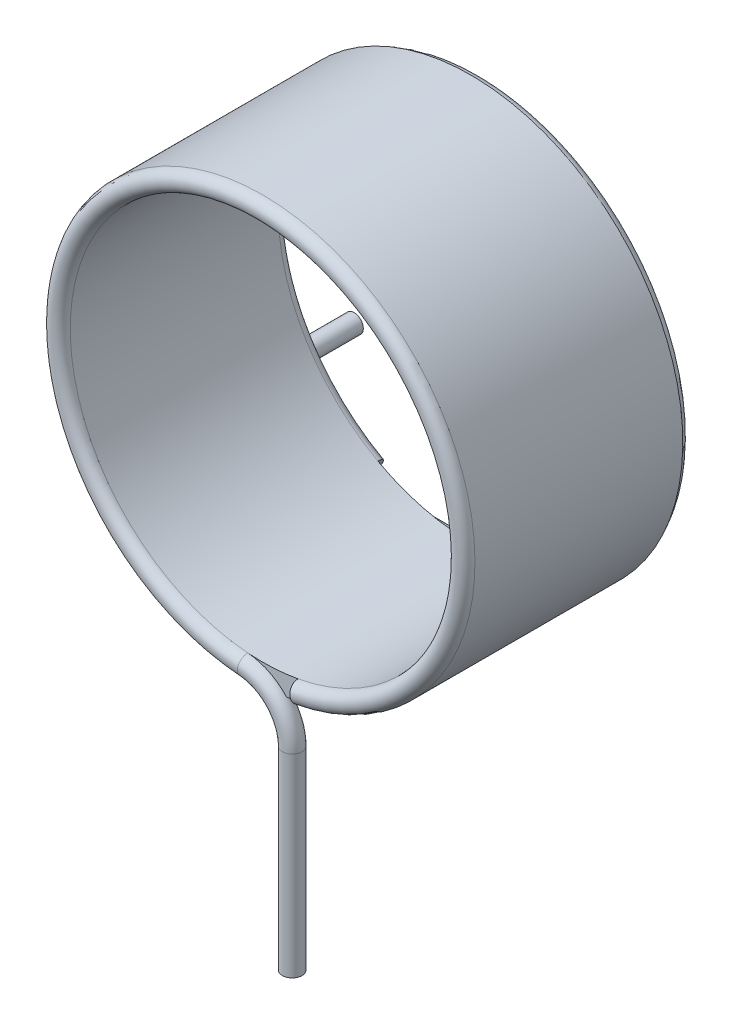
from build123d import *

# Parameters (mm, degrees)
ESQUISSE1_R          = 17.35
ESQUISSE1_R_2        = 15.75
BASE_EXTRUSION_DEPTH = 17
ESQUISSE4_R          = 0.75
ESQUISSE6_R          = 0.8


with BuildPart() as part:
    # Esquisse1 → Base-Extrusion (new body)
    with BuildSketch(Plane.XY):
        with Locations(Location((0, 0, 0), (0, 0, 245.200477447))):
            Circle(ESQUISSE1_R)
        with Locations(Location((0, 0, 0), (0, 0, 241.210322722))):
            Circle(ESQUISSE1_R_2, mode=Mode.SUBTRACT)
    extrude(amount=BASE_EXTRUSION_DEPTH)

    # Boss.-Balayage2: sweep along a curve in space
    with BuildLine() as boss_balayage2_path:
        ThreePointArc((-7.94633046, -14.460492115, 0), (4.101943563, 15.98199171, 0), (-2.37e-07, -16.5, 0))
        Line((-2.37e-07, -16.5, 0), (-18.446343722, -16.499999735, 0))
        Line((-18.446343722, -16.499999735, 0), (-19.530146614, -16.499999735, 0))
        ThreePointArc((-19.530146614, -16.499999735, 0), (-20.590806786, -16.499999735, -0.439339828), (-21.030146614, -16.499999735, -1.5))
        Line((-21.030146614, -16.499999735, -1.5), (-21.030146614, -16.499999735, -11.5))
    # Esquisse4 → Boss.-Balayage2 (sweep)
    with BuildSketch(Plane(origin=(-21.030146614, -16.499999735, -11.5), x_dir=(-1, 0, 0), z_dir=(0, 0, -1))):
        Circle(ESQUISSE4_R)
    sweep(path=boss_balayage2_path.line)

    # Boss.-Balayage3: sweep along a path in Esquisse5
    with BuildLine(Plane.XY.offset(17)) as boss_balayage3_path:
        Line((2.403805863, -36.346923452), (2.403805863, -20.487915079))
        ThreePointArc((2.403805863, -20.487915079), (1.340026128, -17.77155528), (-1.285499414, -16.499999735))
        ThreePointArc((-1.285499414, -16.499999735), (-0.877272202, 16.526732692), (3.025059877, -16.271186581))
    # Esquisse6 → Boss.-Balayage3 (sweep)
    with BuildSketch(Plane(origin=(2.403805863, -36.346923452, 17), x_dir=(-1, 0, 0), z_dir=(0, 1, 0))):
        Circle(ESQUISSE6_R)
    sweep(path=boss_balayage3_path.line)


solid = part.part
